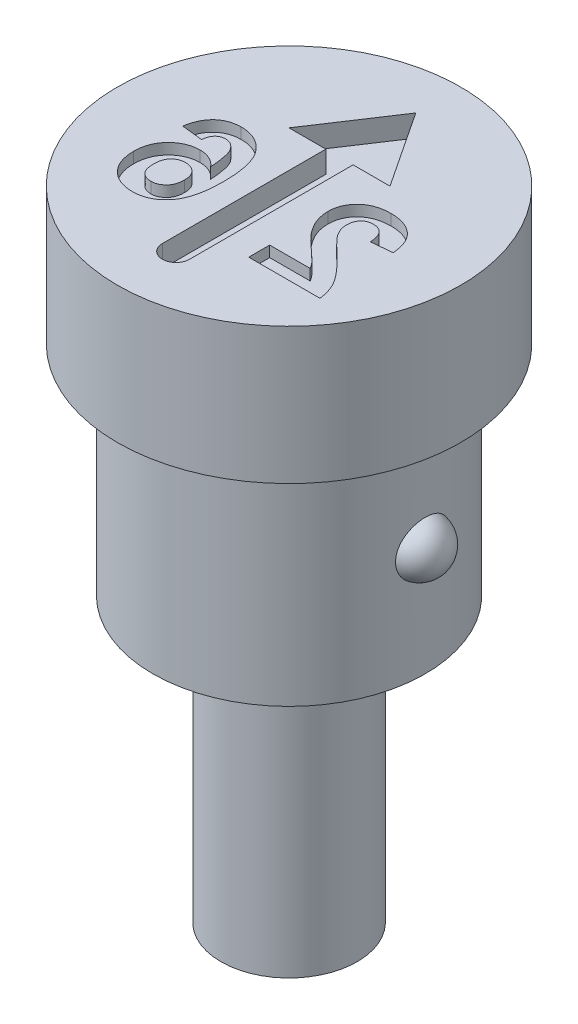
from build123d import *

# Parameters (mm, degrees)
CUT_EXTRUDE1_DEPTH = 0.4
CUT_EXTRUDE2_DEPTH = 0.2


with BuildPart() as part:
    # Sketch1 → Revolve1 (revolve)
    with BuildSketch(Plane.XY, mode=Mode.PRIVATE) as revolve1_sk:
        Polygon((0, 0), (-3.15, 0), (-3.15, -2.5), (-2.5, -2.5), (-2.5, -6.5), (-1.25, -6.5), (-1.25, -11.7), (0, -11.7), align=None)
    revolve(revolve1_sk.sketch.rotate(Axis((0, 0, 0), (0, -1, 0)), 270), axis=Axis((0, 0, 0), (0, -1, 0)))

    # Sketch3 → Cut-Extrude1 (cut)
    with BuildSketch(Plane(origin=(0, 0, 0), x_dir=(1, 0, 0), z_dir=(0, 1, 0))):
        with BuildLine():
            Line((0, 2.325), (-0.926639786, 0.925))
            Line((-0.926639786, 0.925), (-0.25, 0.925))
            Line((-0.25, 0.925), (-0.25, -2.075))
            ThreePointArc((-0.25, -2.075), (0, -2.325), (0.25, -2.075))
            Line((0.25, -2.075), (0.25, 0.925))
            Line((0.25, 0.925), (0.926639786, 0.925))
            Line((0.926639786, 0.925), (0, 2.325))
        make_face()
    extrude(amount=-CUT_EXTRUDE1_DEPTH, mode=Mode.SUBTRACT)

    # Sketch4 → Cut-Extrude2 (cut)
    # profile 1 of 2: a face of its own
    with BuildSketch(Plane(origin=(0, 0, 0), x_dir=(1, 0, 0), z_dir=(0, 1, 0))):
        with BuildLine():
            Line((0.759195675, -1.11435643), (0.759195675, -1.498971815))
            Line((0.759195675, -1.498971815), (2.066887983, -1.498971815))
            add(Edge.make_bspline(
                [(2.066887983, -1.498971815), (2.06246044, -1.46610085), (2.053607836, -1.400377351), (2.02623875, -1.304371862), (1.989710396, -1.210686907), (1.950065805, -1.134450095), (1.910634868, -1.073082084), (1.874859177, -1.022796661), (1.832180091, -0.96929513), (1.78321693, -0.912145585), (1.728240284, -0.851169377), (1.666839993, -0.786593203), (1.598723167, -0.718726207), (1.550801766, -0.672641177), (1.526022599, -0.648811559)],
                knots=[0, 0, 0, 0, 1.156289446, 2.311930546, 3.473459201, 4.661751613, 5.303057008, 6.018253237, 6.81459331, 7.690699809, 8.644447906, 9.679642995, 10.800191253, 12, 12, 12, 12], degree=3))
            add(Edge.make_bspline(
                [(1.526022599, -0.648811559), (1.506248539, -0.629724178), (1.468604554, -0.593387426), (1.414999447, -0.541354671), (1.367875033, -0.493521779), (1.326246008, -0.451128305), (1.291074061, -0.413094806), (1.261896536, -0.380018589), (1.238343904, -0.35176496), (1.225587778, -0.33384084), (1.219932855, -0.325894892)],
                knots=[0, 0, 0, 0, 1.480720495, 2.818855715, 4.024636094, 5.098235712, 6.019786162, 6.815086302, 7.474715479, 8, 8, 8, 8], degree=3))
            add(Edge.make_bspline(
                [(1.219932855, -0.325894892), (1.208352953, -0.306659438), (1.186016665, -0.269556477), (1.161523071, -0.211211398), (1.146821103, -0.152878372), (1.144803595, -0.113900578), (1.14381106, -0.09472502)],
                knots=[0, 0, 0, 0, 1.0911822, 2.104764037, 3.067617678, 4, 4, 4, 4], degree=3))
            add(Edge.make_bspline(
                [(1.14381106, -0.09472502), (1.144531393, -0.074770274), (1.145894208, -0.037017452), (1.157321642, 0.016258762), (1.177586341, 0.062057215), (1.205487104, 0.100518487), (1.240767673, 0.130652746), (1.282011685, 0.152919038), (1.329822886, 0.165229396), (1.363427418, 0.166848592), (1.380990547, 0.167694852)],
                knots=[0, 0, 0, 0, 1.193122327, 2.257294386, 3.237245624, 4.168877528, 5.075331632, 5.990371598, 6.949684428, 8, 8, 8, 8], degree=3))
            add(Edge.make_bspline(
                [(1.380990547, 0.167694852), (1.398435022, 0.166904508), (1.43213398, 0.165377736), (1.480027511, 0.152040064), (1.521925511, 0.12895115), (1.551784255, 0.102639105), (1.571955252, 0.077052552), (1.585699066, 0.054755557), (1.597545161, 0.029419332), (1.608041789, 0.001329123), (1.616332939, -0.029836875), (1.623010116, -0.063841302), (1.628390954, -0.100867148), (1.630102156, -0.126624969), (1.630990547, -0.139997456)],
                knots=[0, 0, 0, 0, 1.402788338, 2.709884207, 3.961032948, 5.225417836, 5.883680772, 6.578928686, 7.329201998, 8.132101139, 8.990263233, 9.922304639, 10.921339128, 12, 12, 12, 12], degree=3))
            Line((1.630990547, -0.139997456), (2.015605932, -0.1023372))
            add(Edge.make_bspline(
                [(2.015605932, -0.1023372), (2.012513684, -0.076370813), (2.006518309, -0.026026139), (1.99155675, 0.046286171), (1.97260849, 0.112997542), (1.948770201, 0.173984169), (1.92102715, 0.229633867), (1.887964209, 0.279111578), (1.850736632, 0.322965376), (1.809312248, 0.36117192), (1.763954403, 0.393852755), (1.716359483, 0.423025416), (1.665597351, 0.446956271), (1.6122269, 0.466678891), (1.556272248, 0.482441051), (1.497474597, 0.492862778), (1.436196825, 0.500193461), (1.394368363, 0.50074575), (1.372977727, 0.501028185)],
                knots=[0, 0, 0, 0, 1.270971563, 2.464210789, 3.586263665, 4.638946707, 5.643716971, 6.603612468, 7.52484387, 8.434700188, 9.336036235, 10.239171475, 11.145359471, 12.059630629, 13.003312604, 13.96741569, 14.960557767, 16, 16, 16, 16], degree=3))
            add(Edge.make_bspline(
                [(1.372977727, 0.501028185), (1.349723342, 0.500581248), (1.304432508, 0.499710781), (1.238315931, 0.492522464), (1.176204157, 0.47998859), (1.117554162, 0.463385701), (1.062968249, 0.44121963), (1.011991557, 0.414421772), (0.965426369, 0.381975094), (0.922578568, 0.345649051), (0.884276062, 0.305702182), (0.850726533, 0.263092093), (0.822618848, 0.217848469), (0.799032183, 0.170522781), (0.781519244, 0.12035349), (0.768758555, 0.0680343), (0.760297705, 0.01332113), (0.759567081, -0.024046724), (0.759195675, -0.043042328)],
                knots=[0, 0, 0, 0, 1.210756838, 2.35810096, 3.457354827, 4.507168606, 5.527358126, 6.519769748, 7.499700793, 8.476517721, 9.440526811, 10.376769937, 11.295256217, 12.209626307, 13.124630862, 14.055668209, 15.011616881, 16, 16, 16, 16], degree=3))
            add(Edge.make_bspline(
                [(0.759195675, -0.043042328), (0.759684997, -0.064843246), (0.760655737, -0.108092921), (0.769949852, -0.172028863), (0.784149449, -0.234490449), (0.805135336, -0.295630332), (0.831736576, -0.356915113), (0.866026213, -0.418482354), (0.905839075, -0.482188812), (0.937010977, -0.523377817), (0.953105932, -0.544644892)],
                knots=[0, 0, 0, 0, 0.953409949, 1.89141903, 2.821310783, 3.752688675, 4.715703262, 5.740811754, 6.833515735, 8, 8, 8, 8], degree=3))
            add(Edge.make_bspline(
                [(0.953105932, -0.544644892), (0.959189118, -0.552306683), (0.972217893, -0.568716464), (0.994383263, -0.593878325), (1.020071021, -0.621363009), (1.048918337, -0.651684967), (1.081878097, -0.683770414), (1.117764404, -0.718961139), (1.158156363, -0.755457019), (1.199992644, -0.79416845), (1.242010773, -0.831845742), (1.280631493, -0.867630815), (1.315711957, -0.89929292), (1.345618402, -0.928579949), (1.372109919, -0.953493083), (1.394231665, -0.975309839), (1.412397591, -0.993502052), (1.437429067, -1.021859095), (1.46927878, -1.060212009), (1.491686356, -1.096859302), (1.502384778, -1.11435643)],
                knots=[0, 0, 0, 0, 0.665555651, 1.425465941, 2.280616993, 3.225313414, 4.272635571, 5.410053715, 6.644756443, 7.976022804, 9.288331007, 10.484517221, 11.558462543, 12.503158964, 13.33222979, 14.032602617, 14.617328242, 15.080653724, 16.606167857, 18, 18, 18, 18], degree=3))
            Line((1.502384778, -1.11435643), (0.759195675, -1.11435643))
        make_face()
    # profile 2 of 2: a face of its own
    with BuildSketch(Plane(origin=(0, 0, 0), x_dir=(1, 0, 0), z_dir=(0, 1, 0))):
        with BuildLine():
            Line((-1.927983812, -0.021007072), (-1.543368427, -0.063074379))
            add(Edge.make_bspline(
                [(-1.543368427, -0.063074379), (-1.540791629, -0.044549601), (-1.535942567, -0.009689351), (-1.521579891, 0.03841777), (-1.501585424, 0.078888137), (-1.475920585, 0.111778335), (-1.445351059, 0.137091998), (-1.410518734, 0.155078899), (-1.37144575, 0.165756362), (-1.344051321, 0.167032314), (-1.32982676, 0.167694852)],
                knots=[0, 0, 0, 0, 1.280716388, 2.410074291, 3.425374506, 4.35753932, 5.248331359, 6.12451615, 7.026154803, 8, 8, 8, 8], degree=3))
            add(Edge.make_bspline(
                [(-1.32982676, 0.167694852), (-1.320180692, 0.167458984), (-1.300985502, 0.16698962), (-1.273025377, 0.161030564), (-1.246068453, 0.152187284), (-1.220334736, 0.139662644), (-1.19569583, 0.123501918), (-1.172526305, 0.10351194), (-1.149760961, 0.080746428), (-1.128739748, 0.053256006), (-1.10857234, 0.020705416), (-1.091207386, -0.019142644), (-1.075729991, -0.066251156), (-1.062478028, -0.120850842), (-1.050452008, -0.18259514), (-1.040594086, -0.251733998), (-1.032705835, -0.328329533), (-1.028921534, -0.381971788), (-1.026942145, -0.410029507)],
                knots=[0, 0, 0, 0, 0.642458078, 1.278459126, 1.898279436, 2.531842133, 3.181731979, 3.858193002, 4.57010051, 5.325711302, 6.161524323, 7.118599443, 8.217371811, 9.466325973, 10.864147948, 12.412648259, 14.123626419, 16, 16, 16, 16], degree=3))
            add(Edge.make_bspline(
                [(-1.026942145, -0.410029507), (-1.039234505, -0.396678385), (-1.063338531, -0.370498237), (-1.103334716, -0.33636534), (-1.145236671, -0.307183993), (-1.18950035, -0.283243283), (-1.236367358, -0.265427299), (-1.284988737, -0.251899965), (-1.336000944, -0.244322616), (-1.370668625, -0.243155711), (-1.38832035, -0.242561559)],
                knots=[0, 0, 0, 0, 1.057745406, 2.074127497, 3.059409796, 4.031705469, 5.000875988, 5.977809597, 6.970362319, 8, 8, 8, 8], degree=3))
            add(Edge.make_bspline(
                [(-1.38832035, -0.242561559), (-1.408241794, -0.243135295), (-1.447579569, -0.244268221), (-1.505533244, -0.252214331), (-1.561143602, -0.266502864), (-1.614662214, -0.285831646), (-1.666353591, -0.310171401), (-1.715228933, -0.340981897), (-1.762055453, -0.376905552), (-1.806189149, -0.417947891), (-1.846737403, -0.46313206), (-1.8825375, -0.511934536), (-1.911999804, -0.564504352), (-1.937186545, -0.61966455), (-1.955926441, -0.678504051), (-1.969529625, -0.740176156), (-1.977649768, -0.805246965), (-1.978718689, -0.849643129), (-1.979265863, -0.872369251)],
                knots=[0, 0, 0, 0, 0.99135015, 1.957564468, 2.903754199, 3.843479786, 4.78583385, 5.741106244, 6.712813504, 7.719198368, 8.735844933, 9.730198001, 10.724351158, 11.729813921, 12.742848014, 13.790983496, 14.86921809, 16, 16, 16, 16], degree=3))
            add(Edge.make_bspline(
                [(-1.979265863, -0.872369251), (-1.978710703, -0.896427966), (-1.977628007, -0.943348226), (-1.969658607, -1.012064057), (-1.955581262, -1.076924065), (-1.936348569, -1.138448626), (-1.91147164, -1.196150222), (-1.881335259, -1.250504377), (-1.844919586, -1.300582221), (-1.80387725, -1.347057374), (-1.758123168, -1.388530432), (-1.709362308, -1.425255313), (-1.657053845, -1.455783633), (-1.601970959, -1.481478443), (-1.543167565, -1.500335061), (-1.481680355, -1.514476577), (-1.417009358, -1.523101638), (-1.372855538, -1.52410127), (-1.350259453, -1.524612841)],
                knots=[0, 0, 0, 0, 1.13287417, 2.209376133, 3.25169942, 4.254157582, 5.240146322, 6.205890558, 7.174579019, 8.150183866, 9.1206468, 10.07783463, 11.019441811, 11.967766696, 12.934309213, 13.921380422, 14.936249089, 16, 16, 16, 16], degree=3))
            add(Edge.make_bspline(
                [(-1.350259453, -1.524612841), (-1.326048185, -1.523935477), (-1.278444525, -1.522603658), (-1.208758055, -1.511643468), (-1.142506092, -1.49310056), (-1.079696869, -1.467204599), (-1.019808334, -1.434631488), (-0.963396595, -1.394169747), (-0.910611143, -1.346205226), (-0.860753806, -1.291387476), (-0.815384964, -1.228068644), (-0.776748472, -1.154885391), (-0.743980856, -1.072639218), (-0.717303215, -0.981119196), (-0.696710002, -0.880332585), (-0.682340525, -0.770270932), (-0.67279619, -0.651116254), (-0.67199074, -0.568569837), (-0.671573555, -0.525814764)],
                knots=[0, 0, 0, 0, 0.852151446, 1.675481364, 2.476404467, 3.269281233, 4.062617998, 4.871616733, 5.707301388, 6.56955125, 7.476395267, 8.442009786, 9.475854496, 10.58877921, 11.794095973, 13.094195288, 14.494932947, 16, 16, 16, 16], degree=3))
            add(Edge.make_bspline(
                [(-0.671573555, -0.525814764), (-0.672171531, -0.481993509), (-0.673326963, -0.397320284), (-0.682624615, -0.275063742), (-0.697393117, -0.162165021), (-0.71890714, -0.058878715), (-0.746425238, 0.035009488), (-0.779786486, 0.119688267), (-0.819829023, 0.194851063), (-0.866384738, 0.260253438), (-0.917609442, 0.317105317), (-0.97265061, 0.36617814), (-1.031298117, 0.407946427), (-1.093550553, 0.442304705), (-1.15991896, 0.468351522), (-1.229773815, 0.487160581), (-1.303232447, 0.499248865), (-1.353550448, 0.500428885), (-1.379105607, 0.501028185)],
                knots=[0, 0, 0, 0, 1.491699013, 2.882321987, 4.171520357, 5.365488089, 6.470299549, 7.49861535, 8.458736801, 9.361983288, 10.224742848, 11.058789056, 11.867429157, 12.671146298, 13.473202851, 14.288259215, 15.130652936, 16, 16, 16, 16], degree=3))
            add(Edge.make_bspline(
                [(-1.379105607, 0.501028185), (-1.39715614, 0.500703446), (-1.432442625, 0.500068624), (-1.484160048, 0.493327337), (-1.533497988, 0.483018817), (-1.580585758, 0.468749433), (-1.625091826, 0.449639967), (-1.667192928, 0.426360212), (-1.707030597, 0.398973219), (-1.744397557, 0.367655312), (-1.778993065, 0.332311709), (-1.810232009, 0.292862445), (-1.838321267, 0.249783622), (-1.863383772, 0.203110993), (-1.884405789, 0.15239755), (-1.902477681, 0.098042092), (-1.917340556, 0.039927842), (-1.924381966, -0.000385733), (-1.927983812, -0.021007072)],
                knots=[0, 0, 0, 0, 1.036027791, 2.025301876, 2.989435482, 3.928225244, 4.845595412, 5.765526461, 6.686607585, 7.61747015, 8.561102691, 9.521661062, 10.50224679, 11.510949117, 12.559251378, 13.650572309, 14.798212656, 16, 16, 16, 16], degree=3))
        make_face()
        with BuildLine():
            add(Edge.make_bspline(
                [(-1.05618894, -0.863555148), (-1.056334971, -0.876257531), (-1.056620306, -0.901077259), (-1.061299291, -0.937092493), (-1.068024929, -0.970856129), (-1.077083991, -1.002555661), (-1.089640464, -1.031711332), (-1.104537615, -1.058907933), (-1.122158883, -1.083899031), (-1.149196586, -1.113220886), (-1.186557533, -1.144017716), (-1.235588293, -1.171442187), (-1.288123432, -1.188489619), (-1.324360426, -1.190343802), (-1.342647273, -1.191279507)],
                knots=[0, 0, 0, 0, 0.93816693, 1.833124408, 2.679057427, 3.481731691, 4.264557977, 5.020023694, 5.770442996, 6.518065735, 7.962605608, 9.32780964, 10.651490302, 12, 12, 12, 12], degree=3))
            add(Edge.make_bspline(
                [(-1.342647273, -1.191279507), (-1.359970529, -1.190502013), (-1.393688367, -1.188988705), (-1.441838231, -1.175158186), (-1.485575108, -1.153346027), (-1.517637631, -1.127738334), (-1.539994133, -1.102831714), (-1.555017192, -1.080989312), (-1.567245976, -1.05607257), (-1.577243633, -1.028491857), (-1.585296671, -0.998353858), (-1.590794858, -0.965355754), (-1.593913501, -0.929587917), (-1.594398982, -0.90482747), (-1.594650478, -0.892000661)],
                knots=[0, 0, 0, 0, 1.399678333, 2.724321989, 4.020062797, 5.33532049, 6.016755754, 6.724441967, 7.473839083, 8.257094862, 9.096253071, 9.995581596, 10.961638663, 12, 12, 12, 12], degree=3))
            add(Edge.make_bspline(
                [(-1.594650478, -0.892000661), (-1.594435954, -0.878770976), (-1.594021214, -0.853194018), (-1.590391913, -0.816226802), (-1.584454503, -0.782052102), (-1.576153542, -0.750428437), (-1.564917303, -0.721778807), (-1.551661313, -0.695525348), (-1.535567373, -0.672379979), (-1.511649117, -0.645158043), (-1.476871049, -0.617728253), (-1.430400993, -0.592744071), (-1.378312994, -0.578580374), (-1.342062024, -0.576807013), (-1.323416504, -0.575894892)],
                knots=[0, 0, 0, 0, 1.008384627, 1.949510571, 2.828269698, 3.650667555, 4.437180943, 5.170285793, 5.887596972, 6.580056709, 7.926803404, 9.238379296, 10.579573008, 12, 12, 12, 12], degree=3))
            add(Edge.make_bspline(
                [(-1.323416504, -0.575894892), (-1.305288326, -0.576633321), (-1.270080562, -0.578067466), (-1.21948284, -0.592469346), (-1.173185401, -0.615385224), (-1.139084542, -0.642306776), (-1.115049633, -0.667679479), (-1.099307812, -0.689282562), (-1.085605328, -0.712802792), (-1.074784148, -0.738848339), (-1.066441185, -0.76693044), (-1.060457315, -0.797240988), (-1.056836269, -0.829679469), (-1.056408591, -0.852060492), (-1.05618894, -0.863555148)],
                knots=[0, 0, 0, 0, 1.469034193, 2.853094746, 4.235454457, 5.641396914, 6.354997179, 7.06867986, 7.807229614, 8.560602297, 9.353235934, 10.182779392, 11.06669468, 12, 12, 12, 12], degree=3))
        make_face(mode=Mode.SUBTRACT)
    extrude(amount=-CUT_EXTRUDE2_DEPTH, mode=Mode.SUBTRACT)

    # Sketch5 → Revolve2 (revolve)
    with BuildSketch(Plane.XY):
        with BuildLine():
            Line((2.388481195, -4), (2.388481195, -5))
            ThreePointArc((2.388481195, -5), (2.888481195, -4.5), (2.388481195, -4))
        make_face()
    revolve(axis=Axis((2.388481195, -4, 0), (0, -1, 0)))


solid = part.part
